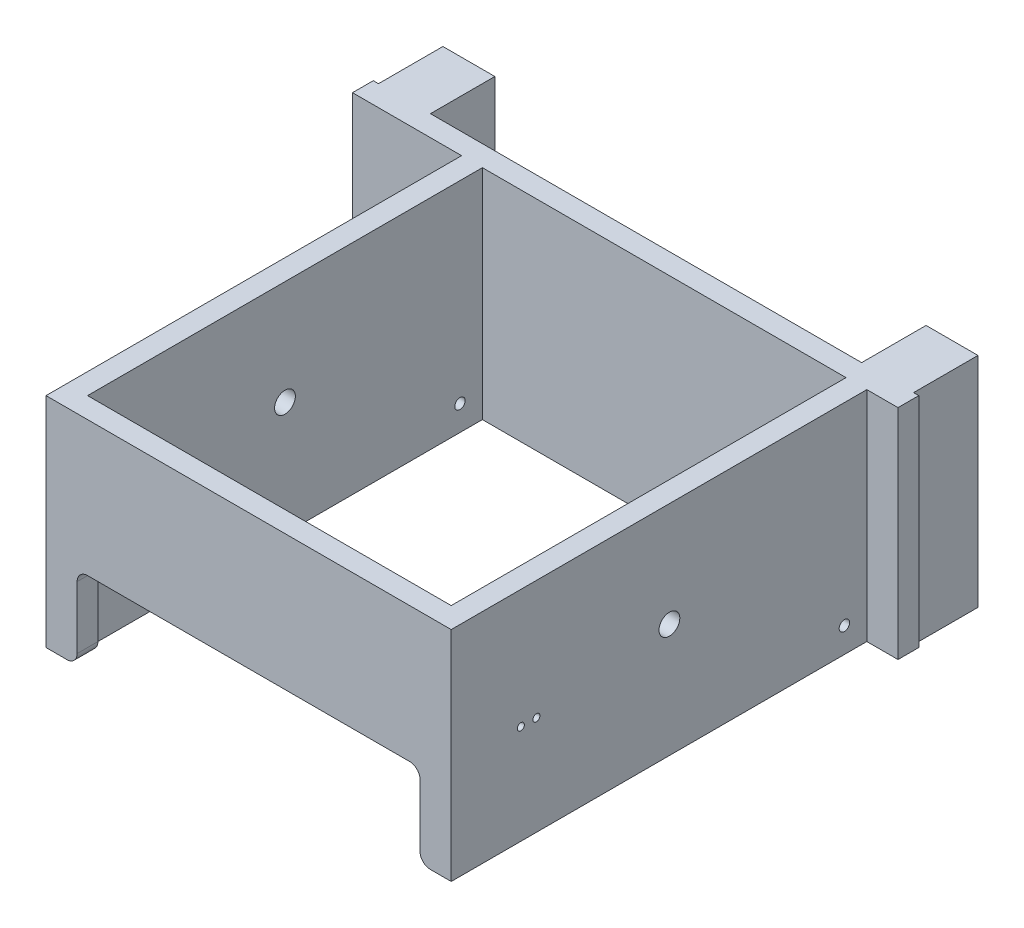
ISO-10303-21;
HEADER;
FILE_DESCRIPTION(('STEP AP214'),'2;1');
FILE_NAME('part.step','',(''),(''),'','','');
FILE_SCHEMA(('AUTOMOTIVE_DESIGN { 1 0 10303 214 1 1 1 1 }'));
ENDSEC;
DATA;
#1=APPLICATION_CONTEXT('core data for automotive mechanical design processes');
#2=APPLICATION_PROTOCOL_DEFINITION('international standard','automotive_design',2000,#1);
#3=PRODUCT_CONTEXT('',#1,'mechanical');
#4=PRODUCT('Part','Part','',(#3));
#5=PRODUCT_RELATED_PRODUCT_CATEGORY('part','',(#4));
#6=PRODUCT_DEFINITION_FORMATION('','',#4);
#7=PRODUCT_DEFINITION_CONTEXT('part definition',#1,'design');
#8=PRODUCT_DEFINITION('design','',#6,#7);
#9=PRODUCT_DEFINITION_SHAPE('','',#8);
#10=(LENGTH_UNIT() NAMED_UNIT(*) SI_UNIT(.MILLI.,.METRE.));
#11=(NAMED_UNIT(*) PLANE_ANGLE_UNIT() SI_UNIT($,.RADIAN.));
#12=(NAMED_UNIT(*) SI_UNIT($,.STERADIAN.) SOLID_ANGLE_UNIT());
#13=UNCERTAINTY_MEASURE_WITH_UNIT(LENGTH_MEASURE(1.E-05),#10,'distance_accuracy_value','');
#14=(GEOMETRIC_REPRESENTATION_CONTEXT(3) GLOBAL_UNCERTAINTY_ASSIGNED_CONTEXT((#13)) GLOBAL_UNIT_ASSIGNED_CONTEXT((#10,
#11,#12)) REPRESENTATION_CONTEXT('',''));
#15=CARTESIAN_POINT('',(0.,0.,0.));
#16=DIRECTION('',(0.,0.,1.));
#17=DIRECTION('',(1.,0.,0.));
#18=AXIS2_PLACEMENT_3D('',#15,#16,#17);
#19=CARTESIAN_POINT('',(-64.7749722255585,-173.320856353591,0.));
#20=DIRECTION('',(0.,0.,1.));
#21=DIRECTION('',(1.,0.,0.));
#22=AXIS2_PLACEMENT_3D('',#19,#20,#21);
#23=PLANE('',#22);
#24=DIRECTION('',(0.,1.,0.));
#25=VECTOR('',#24,1.);
#26=CARTESIAN_POINT('',(405.225027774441,-173.320856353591,0.));
#27=LINE('',#26,#25);
#28=CARTESIAN_POINT('',(405.225027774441,-173.320856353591,0.));
#29=VERTEX_POINT('',#28);
#30=CARTESIAN_POINT('',(405.225027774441,36.6791436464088,0.));
#31=VERTEX_POINT('',#30);
#32=EDGE_CURVE('E297',#29,#31,#27,.T.);
#33=ORIENTED_EDGE('',*,*,#32,.F.);
#34=DIRECTION('',(1.,0.,0.));
#35=VECTOR('',#34,1.);
#36=CARTESIAN_POINT('',(-64.7749722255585,-173.320856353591,0.));
#37=LINE('',#36,#35);
#38=CARTESIAN_POINT('',(-9.77497222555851,-173.320856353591,0.));
#39=VERTEX_POINT('',#38);
#40=EDGE_CURVE('E447',#39,#29,#37,.T.);
#41=ORIENTED_EDGE('',*,*,#40,.F.);
#42=DIRECTION('',(0.,-1.,0.));
#43=VECTOR('',#42,1.);
#44=CARTESIAN_POINT('',(-9.77497222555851,-173.320856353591,0.));
#45=LINE('',#44,#43);
#46=CARTESIAN_POINT('',(-9.77497222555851,36.6791436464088,0.));
#47=VERTEX_POINT('',#46);
#48=EDGE_CURVE('E325',#47,#39,#45,.T.);
#49=ORIENTED_EDGE('',*,*,#48,.F.);
#50=DIRECTION('',(-1.,0.,0.));
#51=VECTOR('',#50,1.);
#52=CARTESIAN_POINT('',(-64.7749722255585,36.6791436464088,0.));
#53=LINE('',#52,#51);
#54=EDGE_CURVE('E347',#31,#47,#53,.T.);
#55=ORIENTED_EDGE('',*,*,#54,.F.);
#56=EDGE_LOOP('',(#33,#41,#49,#55));
#57=FACE_BOUND('',#56,.T.);
#58=ADVANCED_FACE('F39',(#57),#23,.F.);
#59=DIRECTION('',(0.,-1.,0.));
#60=VECTOR('',#59,1.);
#61=CARTESIAN_POINT('',(455.225027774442,-173.320856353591,0.));
#62=LINE('',#61,#60);
#63=CARTESIAN_POINT('',(455.225027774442,36.6791436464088,0.));
#64=VERTEX_POINT('',#63);
#65=CARTESIAN_POINT('',(455.225027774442,-173.320856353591,0.));
#66=VERTEX_POINT('',#65);
#67=EDGE_CURVE('E302',#64,#66,#62,.T.);
#68=ORIENTED_EDGE('',*,*,#67,.F.);
#69=CARTESIAN_POINT('',(460.225027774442,36.6791436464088,0.));
#70=VERTEX_POINT('',#69);
#71=EDGE_CURVE('E350',#70,#64,#53,.T.);
#72=ORIENTED_EDGE('',*,*,#71,.F.);
#73=DIRECTION('',(0.,1.,0.));
#74=VECTOR('',#73,1.);
#75=CARTESIAN_POINT('',(460.225027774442,36.6791436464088,0.));
#76=LINE('',#75,#74);
#77=CARTESIAN_POINT('',(460.225027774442,-173.320856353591,0.));
#78=VERTEX_POINT('',#77);
#79=EDGE_CURVE('E358',#78,#70,#76,.T.);
#80=ORIENTED_EDGE('',*,*,#79,.F.);
#81=EDGE_CURVE('E352',#66,#78,#37,.T.);
#82=ORIENTED_EDGE('',*,*,#81,.F.);
#83=EDGE_LOOP('',(#68,#72,#80,#82));
#84=FACE_BOUND('',#83,.T.);
#85=ADVANCED_FACE('F645',(#84),#23,.F.);
#86=DIRECTION('',(0.,1.,0.));
#87=VECTOR('',#86,1.);
#88=CARTESIAN_POINT('',(-59.7749722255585,-173.320856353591,0.));
#89=LINE('',#88,#87);
#90=CARTESIAN_POINT('',(-59.7749722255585,-173.320856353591,0.));
#91=VERTEX_POINT('',#90);
#92=CARTESIAN_POINT('',(-59.7749722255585,36.6791436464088,0.));
#93=VERTEX_POINT('',#92);
#94=EDGE_CURVE('E320',#91,#93,#89,.T.);
#95=ORIENTED_EDGE('',*,*,#94,.F.);
#96=CARTESIAN_POINT('',(-64.7749722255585,-173.320856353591,0.));
#97=VERTEX_POINT('',#96);
#98=EDGE_CURVE('E452',#97,#91,#37,.T.);
#99=ORIENTED_EDGE('',*,*,#98,.F.);
#100=DIRECTION('',(0.,-1.,0.));
#101=VECTOR('',#100,1.);
#102=CARTESIAN_POINT('',(-64.7749722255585,36.6791436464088,0.));
#103=LINE('',#102,#101);
#104=CARTESIAN_POINT('',(-64.7749722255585,36.6791436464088,0.));
#105=VERTEX_POINT('',#104);
#106=EDGE_CURVE('E401',#105,#97,#103,.T.);
#107=ORIENTED_EDGE('',*,*,#106,.F.);
#108=EDGE_CURVE('E351',#93,#105,#53,.T.);
#109=ORIENTED_EDGE('',*,*,#108,.F.);
#110=EDGE_LOOP('',(#95,#99,#107,#109));
#111=FACE_BOUND('',#110,.T.);
#112=ADVANCED_FACE('F614',(#111),#23,.F.);
#113=CARTESIAN_POINT('',(410.225027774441,36.6791436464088,420.));
#114=DIRECTION('',(1.,0.,0.));
#115=DIRECTION('',(0.,0.,-1.));
#116=AXIS2_PLACEMENT_3D('',#113,#114,#115);
#117=PLANE('',#116);
#118=CARTESIAN_POINT('',(410.225027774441,-77.8208563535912,353.));
#119=DIRECTION('',(1.,0.,0.));
#120=DIRECTION('',(0.,0.,-1.));
#121=AXIS2_PLACEMENT_3D('',#118,#119,#120);
#122=CIRCLE('',#121,3.39999999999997);
#123=CARTESIAN_POINT('',(410.225027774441,-77.8208563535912,349.6));
#124=VERTEX_POINT('',#123);
#125=EDGE_CURVE('E282',#124,#124,#122,.T.);
#126=ORIENTED_EDGE('',*,*,#125,.T.);
#127=EDGE_LOOP('',(#126));
#128=FACE_BOUND('',#127,.T.);
#129=CARTESIAN_POINT('',(410.225027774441,-77.8208563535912,338.));
#130=DIRECTION('',(1.,0.,0.));
#131=DIRECTION('',(0.,0.,-1.));
#132=AXIS2_PLACEMENT_3D('',#129,#130,#131);
#133=CIRCLE('',#132,3.39999999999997);
#134=CARTESIAN_POINT('',(410.225027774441,-77.8208563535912,334.6));
#135=VERTEX_POINT('',#134);
#136=EDGE_CURVE('E291',#135,#135,#133,.T.);
#137=ORIENTED_EDGE('',*,*,#136,.T.);
#138=EDGE_LOOP('',(#137));
#139=FACE_BOUND('',#138,.T.);
#140=CARTESIAN_POINT('',(410.225027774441,-149.158160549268,41.5967225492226));
#141=DIRECTION('',(1.,0.,0.));
#142=DIRECTION('',(0.,0.,-1.));
#143=AXIS2_PLACEMENT_3D('',#140,#141,#142);
#144=CIRCLE('',#143,5.00000000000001);
#145=CARTESIAN_POINT('',(410.225027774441,-149.158160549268,36.5967225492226));
#146=VERTEX_POINT('',#145);
#147=EDGE_CURVE('E480',#146,#146,#144,.T.);
#148=ORIENTED_EDGE('',*,*,#147,.T.);
#149=EDGE_LOOP('',(#148));
#150=FACE_BOUND('',#149,.T.);
#151=CARTESIAN_POINT('',(410.225027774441,-63.8208563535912,210.));
#152=DIRECTION('',(1.,0.,0.));
#153=DIRECTION('',(0.,0.,-1.));
#154=AXIS2_PLACEMENT_3D('',#151,#152,#153);
#155=CIRCLE('',#154,10.);
#156=CARTESIAN_POINT('',(410.225027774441,-63.8208563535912,200.));
#157=VERTEX_POINT('',#156);
#158=EDGE_CURVE('E487',#157,#157,#155,.T.);
#159=ORIENTED_EDGE('',*,*,#158,.T.);
#160=EDGE_LOOP('',(#159));
#161=FACE_BOUND('',#160,.T.);
#162=DIRECTION('',(0.,-1.,0.));
#163=VECTOR('',#162,1.);
#164=CARTESIAN_POINT('',(410.225027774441,36.6791436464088,400.));
#165=LINE('',#164,#163);
#166=CARTESIAN_POINT('',(410.225027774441,36.6791436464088,400.));
#167=VERTEX_POINT('',#166);
#168=CARTESIAN_POINT('',(410.225027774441,-173.320856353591,400.));
#169=VERTEX_POINT('',#168);
#170=EDGE_CURVE('E490',#167,#169,#165,.T.);
#171=ORIENTED_EDGE('',*,*,#170,.F.);
#172=DIRECTION('',(0.,0.,-1.));
#173=VECTOR('',#172,1.);
#174=CARTESIAN_POINT('',(410.225027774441,36.6791436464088,420.));
#175=LINE('',#174,#173);
#176=CARTESIAN_POINT('',(410.225027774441,36.6791436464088,20.));
#177=VERTEX_POINT('',#176);
#178=EDGE_CURVE('E379',#167,#177,#175,.T.);
#179=ORIENTED_EDGE('',*,*,#178,.T.);
#180=DIRECTION('',(0.,-1.,0.));
#181=VECTOR('',#180,1.);
#182=CARTESIAN_POINT('',(410.225027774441,36.6791436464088,20.));
#183=LINE('',#182,#181);
#184=CARTESIAN_POINT('',(410.225027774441,-173.320856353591,20.));
#185=VERTEX_POINT('',#184);
#186=EDGE_CURVE('E390',#177,#185,#183,.T.);
#187=ORIENTED_EDGE('',*,*,#186,.T.);
#188=DIRECTION('',(0.,0.,-1.));
#189=VECTOR('',#188,1.);
#190=CARTESIAN_POINT('',(410.225027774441,-173.320856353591,420.));
#191=LINE('',#190,#189);
#192=EDGE_CURVE('E384',#169,#185,#191,.T.);
#193=ORIENTED_EDGE('',*,*,#192,.F.);
#194=EDGE_LOOP('',(#171,#179,#187,#193));
#195=FACE_BOUND('',#194,.T.);
#196=ADVANCED_FACE('F675',(#128,#139,#150,#161,#195),#117,.F.);
#197=CARTESIAN_POINT('',(60.2250277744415,36.6791436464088,420.));
#198=DIRECTION('',(-1.,0.,0.));
#199=DIRECTION('',(0.,-1.,0.));
#200=AXIS2_PLACEMENT_3D('',#197,#198,#199);
#201=PLANE('',#200);
#202=CARTESIAN_POINT('',(60.2250277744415,-77.8208563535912,353.));
#203=DIRECTION('',(-1.,0.,0.));
#204=DIRECTION('',(0.,-1.,0.));
#205=AXIS2_PLACEMENT_3D('',#202,#203,#204);
#206=CIRCLE('',#205,3.39999999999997);
#207=CARTESIAN_POINT('',(60.2250277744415,-81.2208563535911,353.));
#208=VERTEX_POINT('',#207);
#209=EDGE_CURVE('E279',#208,#208,#206,.T.);
#210=ORIENTED_EDGE('',*,*,#209,.T.);
#211=EDGE_LOOP('',(#210));
#212=FACE_BOUND('',#211,.T.);
#213=CARTESIAN_POINT('',(60.2250277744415,-77.8208563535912,338.));
#214=DIRECTION('',(-1.,0.,0.));
#215=DIRECTION('',(0.,-1.,0.));
#216=AXIS2_PLACEMENT_3D('',#213,#214,#215);
#217=CIRCLE('',#216,3.39999999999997);
#218=CARTESIAN_POINT('',(60.2250277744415,-81.2208563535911,338.));
#219=VERTEX_POINT('',#218);
#220=EDGE_CURVE('E294',#219,#219,#217,.T.);
#221=ORIENTED_EDGE('',*,*,#220,.T.);
#222=EDGE_LOOP('',(#221));
#223=FACE_BOUND('',#222,.T.);
#224=CARTESIAN_POINT('',(60.2250277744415,-149.158160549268,41.5967225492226));
#225=DIRECTION('',(-1.,0.,0.));
#226=DIRECTION('',(0.,-1.,0.));
#227=AXIS2_PLACEMENT_3D('',#224,#225,#226);
#228=CIRCLE('',#227,5.00000000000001);
#229=CARTESIAN_POINT('',(60.2250277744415,-154.158160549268,41.5967225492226));
#230=VERTEX_POINT('',#229);
#231=EDGE_CURVE('E372',#230,#230,#228,.T.);
#232=ORIENTED_EDGE('',*,*,#231,.T.);
#233=EDGE_LOOP('',(#232));
#234=FACE_BOUND('',#233,.T.);
#235=CARTESIAN_POINT('',(60.2250277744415,-63.8208563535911,210.));
#236=DIRECTION('',(-1.,0.,0.));
#237=DIRECTION('',(0.,-1.,0.));
#238=AXIS2_PLACEMENT_3D('',#235,#236,#237);
#239=CIRCLE('',#238,10.);
#240=CARTESIAN_POINT('',(60.2250277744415,-73.8208563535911,210.));
#241=VERTEX_POINT('',#240);
#242=EDGE_CURVE('E377',#241,#241,#239,.T.);
#243=ORIENTED_EDGE('',*,*,#242,.T.);
#244=EDGE_LOOP('',(#243));
#245=FACE_BOUND('',#244,.T.);
#246=DIRECTION('',(0.,-1.,0.));
#247=VECTOR('',#246,1.);
#248=CARTESIAN_POINT('',(60.2250277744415,36.6791436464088,400.));
#249=LINE('',#248,#247);
#250=CARTESIAN_POINT('',(60.2250277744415,36.6791436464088,400.));
#251=VERTEX_POINT('',#250);
#252=CARTESIAN_POINT('',(60.2250277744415,-173.320856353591,400.));
#253=VERTEX_POINT('',#252);
#254=EDGE_CURVE('E491',#251,#253,#249,.T.);
#255=ORIENTED_EDGE('',*,*,#254,.T.);
#256=DIRECTION('',(0.,0.,-1.));
#257=VECTOR('',#256,1.);
#258=CARTESIAN_POINT('',(60.2250277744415,-173.320856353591,420.));
#259=LINE('',#258,#257);
#260=CARTESIAN_POINT('',(60.2250277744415,-173.320856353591,20.));
#261=VERTEX_POINT('',#260);
#262=EDGE_CURVE('E501',#253,#261,#259,.T.);
#263=ORIENTED_EDGE('',*,*,#262,.T.);
#264=DIRECTION('',(0.,1.,0.));
#265=VECTOR('',#264,1.);
#266=CARTESIAN_POINT('',(60.2250277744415,36.6791436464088,20.));
#267=LINE('',#266,#265);
#268=CARTESIAN_POINT('',(60.2250277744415,36.6791436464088,20.));
#269=VERTEX_POINT('',#268);
#270=EDGE_CURVE('E497',#261,#269,#267,.T.);
#271=ORIENTED_EDGE('',*,*,#270,.T.);
#272=DIRECTION('',(0.,0.,-1.));
#273=VECTOR('',#272,1.);
#274=CARTESIAN_POINT('',(60.2250277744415,36.6791436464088,420.));
#275=LINE('',#274,#273);
#276=EDGE_CURVE('E514',#251,#269,#275,.T.);
#277=ORIENTED_EDGE('',*,*,#276,.F.);
#278=EDGE_LOOP('',(#255,#263,#271,#277));
#279=FACE_BOUND('',#278,.T.);
#280=ADVANCED_FACE('F680',(#212,#223,#234,#245,#279),#201,.F.);
#281=CARTESIAN_POINT('',(-64.7749722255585,-173.320856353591,20.));
#282=DIRECTION('',(0.,0.,1.));
#283=DIRECTION('',(1.,0.,0.));
#284=AXIS2_PLACEMENT_3D('',#281,#282,#283);
#285=PLANE('',#284);
#286=DIRECTION('',(-1.,0.,0.));
#287=VECTOR('',#286,1.);
#288=CARTESIAN_POINT('',(-64.7749722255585,36.6791436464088,20.));
#289=LINE('',#288,#287);
#290=EDGE_CURVE('E394',#177,#269,#289,.T.);
#291=ORIENTED_EDGE('',*,*,#290,.T.);
#292=ORIENTED_EDGE('',*,*,#270,.F.);
#293=DIRECTION('',(1.,0.,0.));
#294=VECTOR('',#293,1.);
#295=CARTESIAN_POINT('',(-64.7749722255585,-173.320856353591,20.));
#296=LINE('',#295,#294);
#297=EDGE_CURVE('E396',#261,#185,#296,.T.);
#298=ORIENTED_EDGE('',*,*,#297,.T.);
#299=ORIENTED_EDGE('',*,*,#186,.F.);
#300=EDGE_LOOP('',(#291,#292,#298,#299));
#301=FACE_BOUND('',#300,.T.);
#302=ADVANCED_FACE('F664',(#301),#285,.T.);
#303=CARTESIAN_POINT('',(-64.7749722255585,-173.320856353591,20.));
#304=VERTEX_POINT('',#303);
#305=CARTESIAN_POINT('',(40.2250277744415,-173.320856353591,20.));
#306=VERTEX_POINT('',#305);
#307=EDGE_CURVE('E411',#304,#306,#296,.T.);
#308=ORIENTED_EDGE('',*,*,#307,.T.);
#309=DIRECTION('',(0.,-1.,0.));
#310=VECTOR('',#309,1.);
#311=CARTESIAN_POINT('',(40.2250277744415,36.6791436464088,20.));
#312=LINE('',#311,#310);
#313=CARTESIAN_POINT('',(40.2250277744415,36.6791436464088,20.));
#314=VERTEX_POINT('',#313);
#315=EDGE_CURVE('E502',#314,#306,#312,.T.);
#316=ORIENTED_EDGE('',*,*,#315,.F.);
#317=CARTESIAN_POINT('',(-64.7749722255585,36.6791436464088,20.));
#318=VERTEX_POINT('',#317);
#319=EDGE_CURVE('E392',#314,#318,#289,.T.);
#320=ORIENTED_EDGE('',*,*,#319,.T.);
#321=DIRECTION('',(0.,-1.,0.));
#322=VECTOR('',#321,1.);
#323=CARTESIAN_POINT('',(-64.7749722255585,36.6791436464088,20.));
#324=LINE('',#323,#322);
#325=EDGE_CURVE('E368',#318,#304,#324,.T.);
#326=ORIENTED_EDGE('',*,*,#325,.T.);
#327=EDGE_LOOP('',(#308,#316,#320,#326));
#328=FACE_BOUND('',#327,.T.);
#329=ADVANCED_FACE('F665',(#328),#285,.T.);
#330=CARTESIAN_POINT('',(-64.7749722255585,36.6791436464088,20.));
#331=DIRECTION('',(1.,0.,0.));
#332=DIRECTION('',(0.,1.,0.));
#333=AXIS2_PLACEMENT_3D('',#330,#331,#332);
#334=PLANE('',#333);
#335=ORIENTED_EDGE('',*,*,#106,.T.);
#336=DIRECTION('',(0.,0.,-1.));
#337=VECTOR('',#336,1.);
#338=CARTESIAN_POINT('',(-64.7749722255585,-173.320856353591,20.));
#339=LINE('',#338,#337);
#340=EDGE_CURVE('E603',#304,#97,#339,.T.);
#341=ORIENTED_EDGE('',*,*,#340,.F.);
#342=ORIENTED_EDGE('',*,*,#325,.F.);
#343=DIRECTION('',(0.,0.,-1.));
#344=VECTOR('',#343,1.);
#345=CARTESIAN_POINT('',(-64.7749722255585,36.6791436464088,20.));
#346=LINE('',#345,#344);
#347=EDGE_CURVE('E359',#318,#105,#346,.T.);
#348=ORIENTED_EDGE('',*,*,#347,.T.);
#349=EDGE_LOOP('',(#335,#341,#342,#348));
#350=FACE_BOUND('',#349,.T.);
#351=ADVANCED_FACE('F612',(#350),#334,.F.);
#352=CARTESIAN_POINT('',(-64.7749722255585,-173.320856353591,20.));
#353=DIRECTION('',(0.,1.,0.));
#354=DIRECTION('',(0.,0.,1.));
#355=AXIS2_PLACEMENT_3D('',#352,#353,#354);
#356=PLANE('',#355);
#357=ORIENTED_EDGE('',*,*,#262,.F.);
#358=DIRECTION('',(0.,0.,1.));
#359=VECTOR('',#358,1.);
#360=CARTESIAN_POINT('',(60.2250277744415,-173.320856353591,20.));
#361=LINE('',#360,#359);
#362=CARTESIAN_POINT('',(60.2250277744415,-173.320856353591,420.));
#363=VERTEX_POINT('',#362);
#364=EDGE_CURVE('E537',#253,#363,#361,.T.);
#365=ORIENTED_EDGE('',*,*,#364,.T.);
#366=DIRECTION('',(1.,0.,0.));
#367=VECTOR('',#366,1.);
#368=CARTESIAN_POINT('',(410.225027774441,-173.320856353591,420.));
#369=LINE('',#368,#367);
#370=CARTESIAN_POINT('',(40.2250277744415,-173.320856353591,420.));
#371=VERTEX_POINT('',#370);
#372=EDGE_CURVE('E516',#371,#363,#369,.T.);
#373=ORIENTED_EDGE('',*,*,#372,.F.);
#374=DIRECTION('',(0.,0.,-1.));
#375=VECTOR('',#374,1.);
#376=CARTESIAN_POINT('',(40.2250277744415,-173.320856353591,420.));
#377=LINE('',#376,#375);
#378=EDGE_CURVE('E508',#371,#306,#377,.T.);
#379=ORIENTED_EDGE('',*,*,#378,.T.);
#380=ORIENTED_EDGE('',*,*,#307,.F.);
#381=ORIENTED_EDGE('',*,*,#340,.T.);
#382=ORIENTED_EDGE('',*,*,#98,.T.);
#383=DIRECTION('',(0.,0.,1.));
#384=VECTOR('',#383,1.);
#385=CARTESIAN_POINT('',(-59.7749722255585,-173.320856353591,-62.));
#386=LINE('',#385,#384);
#387=CARTESIAN_POINT('',(-59.7749722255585,-173.320856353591,-62.));
#388=VERTEX_POINT('',#387);
#389=EDGE_CURVE('E331',#388,#91,#386,.T.);
#390=ORIENTED_EDGE('',*,*,#389,.F.);
#391=DIRECTION('',(-1.,0.,0.));
#392=VECTOR('',#391,1.);
#393=CARTESIAN_POINT('',(-59.7749722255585,-173.320856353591,-62.));
#394=LINE('',#393,#392);
#395=CARTESIAN_POINT('',(-9.77497222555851,-173.320856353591,-62.));
#396=VERTEX_POINT('',#395);
#397=EDGE_CURVE('E329',#396,#388,#394,.T.);
#398=ORIENTED_EDGE('',*,*,#397,.F.);
#399=DIRECTION('',(0.,0.,1.));
#400=VECTOR('',#399,1.);
#401=CARTESIAN_POINT('',(-9.77497222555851,-173.320856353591,-62.));
#402=LINE('',#401,#400);
#403=EDGE_CURVE('E344',#396,#39,#402,.T.);
#404=ORIENTED_EDGE('',*,*,#403,.T.);
#405=ORIENTED_EDGE('',*,*,#40,.T.);
#406=DIRECTION('',(0.,0.,1.));
#407=VECTOR('',#406,1.);
#408=CARTESIAN_POINT('',(405.225027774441,-173.320856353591,-62.));
#409=LINE('',#408,#407);
#410=CARTESIAN_POINT('',(405.225027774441,-173.320856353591,-62.));
#411=VERTEX_POINT('',#410);
#412=EDGE_CURVE('E308',#411,#29,#409,.T.);
#413=ORIENTED_EDGE('',*,*,#412,.F.);
#414=DIRECTION('',(-1.,0.,0.));
#415=VECTOR('',#414,1.);
#416=CARTESIAN_POINT('',(405.225027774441,-173.320856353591,-62.));
#417=LINE('',#416,#415);
#418=CARTESIAN_POINT('',(455.225027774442,-173.320856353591,-62.));
#419=VERTEX_POINT('',#418);
#420=EDGE_CURVE('E306',#419,#411,#417,.T.);
#421=ORIENTED_EDGE('',*,*,#420,.F.);
#422=DIRECTION('',(0.,0.,1.));
#423=VECTOR('',#422,1.);
#424=CARTESIAN_POINT('',(455.225027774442,-173.320856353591,-62.));
#425=LINE('',#424,#423);
#426=EDGE_CURVE('E312',#419,#66,#425,.T.);
#427=ORIENTED_EDGE('',*,*,#426,.T.);
#428=ORIENTED_EDGE('',*,*,#81,.T.);
#429=DIRECTION('',(0.,0.,-1.));
#430=VECTOR('',#429,1.);
#431=CARTESIAN_POINT('',(460.225027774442,-173.320856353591,20.));
#432=LINE('',#431,#430);
#433=CARTESIAN_POINT('',(460.225027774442,-173.320856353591,20.));
#434=VERTEX_POINT('',#433);
#435=EDGE_CURVE('E604',#434,#78,#432,.T.);
#436=ORIENTED_EDGE('',*,*,#435,.F.);
#437=CARTESIAN_POINT('',(430.225027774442,-173.320856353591,20.));
#438=VERTEX_POINT('',#437);
#439=EDGE_CURVE('E409',#438,#434,#296,.T.);
#440=ORIENTED_EDGE('',*,*,#439,.F.);
#441=DIRECTION('',(0.,0.,-1.));
#442=VECTOR('',#441,1.);
#443=CARTESIAN_POINT('',(430.225027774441,-173.320856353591,420.));
#444=LINE('',#443,#442);
#445=CARTESIAN_POINT('',(430.225027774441,-173.320856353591,420.));
#446=VERTEX_POINT('',#445);
#447=EDGE_CURVE('E428',#446,#438,#444,.T.);
#448=ORIENTED_EDGE('',*,*,#447,.F.);
#449=CARTESIAN_POINT('',(410.225027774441,-173.320856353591,420.));
#450=VERTEX_POINT('',#449);
#451=EDGE_CURVE('E425',#450,#446,#369,.T.);
#452=ORIENTED_EDGE('',*,*,#451,.F.);
#453=DIRECTION('',(0.,0.,1.));
#454=VECTOR('',#453,1.);
#455=CARTESIAN_POINT('',(410.225027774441,-173.320856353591,20.));
#456=LINE('',#455,#454);
#457=EDGE_CURVE('E571',#450,#169,#456,.F.);
#458=ORIENTED_EDGE('',*,*,#457,.T.);
#459=ORIENTED_EDGE('',*,*,#192,.T.);
#460=ORIENTED_EDGE('',*,*,#297,.F.);
#461=EDGE_LOOP('',(#357,#365,#373,#379,#380,#381,#382,#390,#398,#404,#405,#413,#421,#427,#428,
#436,#440,#448,#452,#458,#459,#460));
#462=FACE_BOUND('',#461,.T.);
#463=ADVANCED_FACE('F533',(#462),#356,.F.);
#464=CARTESIAN_POINT('',(460.225027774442,36.6791436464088,20.));
#465=DIRECTION('',(-1.,0.,0.));
#466=DIRECTION('',(0.,0.,1.));
#467=AXIS2_PLACEMENT_3D('',#464,#465,#466);
#468=PLANE('',#467);
#469=ORIENTED_EDGE('',*,*,#79,.T.);
#470=DIRECTION('',(0.,0.,-1.));
#471=VECTOR('',#470,1.);
#472=CARTESIAN_POINT('',(460.225027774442,36.6791436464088,20.));
#473=LINE('',#472,#471);
#474=CARTESIAN_POINT('',(460.225027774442,36.6791436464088,20.));
#475=VERTEX_POINT('',#474);
#476=EDGE_CURVE('E605',#475,#70,#473,.T.);
#477=ORIENTED_EDGE('',*,*,#476,.F.);
#478=DIRECTION('',(0.,1.,0.));
#479=VECTOR('',#478,1.);
#480=CARTESIAN_POINT('',(460.225027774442,36.6791436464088,20.));
#481=LINE('',#480,#479);
#482=EDGE_CURVE('E395',#434,#475,#481,.T.);
#483=ORIENTED_EDGE('',*,*,#482,.F.);
#484=ORIENTED_EDGE('',*,*,#435,.T.);
#485=EDGE_LOOP('',(#469,#477,#483,#484));
#486=FACE_BOUND('',#485,.T.);
#487=ADVANCED_FACE('F647',(#486),#468,.F.);
#488=CARTESIAN_POINT('',(-64.7749722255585,36.6791436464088,20.));
#489=DIRECTION('',(0.,-1.,0.));
#490=DIRECTION('',(0.,0.,-1.));
#491=AXIS2_PLACEMENT_3D('',#488,#489,#490);
#492=PLANE('',#491);
#493=ORIENTED_EDGE('',*,*,#178,.F.);
#494=DIRECTION('',(1.,0.,0.));
#495=VECTOR('',#494,1.);
#496=CARTESIAN_POINT('',(60.2250277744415,36.6791436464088,400.));
#497=LINE('',#496,#495);
#498=EDGE_CURVE('E494',#251,#167,#497,.T.);
#499=ORIENTED_EDGE('',*,*,#498,.F.);
#500=ORIENTED_EDGE('',*,*,#276,.T.);
#501=ORIENTED_EDGE('',*,*,#290,.F.);
#502=EDGE_LOOP('',(#493,#499,#500,#501));
#503=FACE_BOUND('',#502,.T.);
#504=ORIENTED_EDGE('',*,*,#71,.T.);
#505=DIRECTION('',(0.,0.,1.));
#506=VECTOR('',#505,1.);
#507=CARTESIAN_POINT('',(455.225027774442,36.6791436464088,-62.));
#508=LINE('',#507,#506);
#509=CARTESIAN_POINT('',(455.225027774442,36.6791436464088,-62.));
#510=VERTEX_POINT('',#509);
#511=EDGE_CURVE('E315',#510,#64,#508,.T.);
#512=ORIENTED_EDGE('',*,*,#511,.F.);
#513=DIRECTION('',(1.,0.,0.));
#514=VECTOR('',#513,1.);
#515=CARTESIAN_POINT('',(405.225027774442,36.6791436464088,-62.));
#516=LINE('',#515,#514);
#517=CARTESIAN_POINT('',(405.225027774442,36.6791436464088,-62.));
#518=VERTEX_POINT('',#517);
#519=EDGE_CURVE('E301',#518,#510,#516,.T.);
#520=ORIENTED_EDGE('',*,*,#519,.F.);
#521=DIRECTION('',(0.,0.,1.));
#522=VECTOR('',#521,1.);
#523=CARTESIAN_POINT('',(405.225027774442,36.6791436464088,-62.));
#524=LINE('',#523,#522);
#525=EDGE_CURVE('E317',#518,#31,#524,.T.);
#526=ORIENTED_EDGE('',*,*,#525,.T.);
#527=ORIENTED_EDGE('',*,*,#54,.T.);
#528=DIRECTION('',(0.,0.,1.));
#529=VECTOR('',#528,1.);
#530=CARTESIAN_POINT('',(-9.77497222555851,36.6791436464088,-62.));
#531=LINE('',#530,#529);
#532=CARTESIAN_POINT('',(-9.77497222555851,36.6791436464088,-62.));
#533=VERTEX_POINT('',#532);
#534=EDGE_CURVE('E464',#533,#47,#531,.T.);
#535=ORIENTED_EDGE('',*,*,#534,.F.);
#536=DIRECTION('',(1.,0.,0.));
#537=VECTOR('',#536,1.);
#538=CARTESIAN_POINT('',(-59.7749722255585,36.6791436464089,-62.));
#539=LINE('',#538,#537);
#540=CARTESIAN_POINT('',(-59.7749722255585,36.6791436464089,-62.));
#541=VERTEX_POINT('',#540);
#542=EDGE_CURVE('E324',#541,#533,#539,.T.);
#543=ORIENTED_EDGE('',*,*,#542,.F.);
#544=DIRECTION('',(0.,0.,1.));
#545=VECTOR('',#544,1.);
#546=CARTESIAN_POINT('',(-59.7749722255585,36.6791436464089,-62.));
#547=LINE('',#546,#545);
#548=EDGE_CURVE('E469',#541,#93,#547,.T.);
#549=ORIENTED_EDGE('',*,*,#548,.T.);
#550=ORIENTED_EDGE('',*,*,#108,.T.);
#551=ORIENTED_EDGE('',*,*,#347,.F.);
#552=ORIENTED_EDGE('',*,*,#319,.F.);
#553=DIRECTION('',(0.,0.,-1.));
#554=VECTOR('',#553,1.);
#555=CARTESIAN_POINT('',(40.2250277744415,36.6791436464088,420.));
#556=LINE('',#555,#554);
#557=CARTESIAN_POINT('',(40.2250277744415,36.6791436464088,420.));
#558=VERTEX_POINT('',#557);
#559=EDGE_CURVE('E511',#558,#314,#556,.T.);
#560=ORIENTED_EDGE('',*,*,#559,.F.);
#561=DIRECTION('',(-1.,0.,0.));
#562=VECTOR('',#561,1.);
#563=CARTESIAN_POINT('',(410.225027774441,36.6791436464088,420.));
#564=LINE('',#563,#562);
#565=CARTESIAN_POINT('',(430.225027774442,36.6791436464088,420.));
#566=VERTEX_POINT('',#565);
#567=EDGE_CURVE('E383',#566,#558,#564,.T.);
#568=ORIENTED_EDGE('',*,*,#567,.F.);
#569=DIRECTION('',(0.,0.,-1.));
#570=VECTOR('',#569,1.);
#571=CARTESIAN_POINT('',(430.225027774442,36.6791436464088,420.));
#572=LINE('',#571,#570);
#573=CARTESIAN_POINT('',(430.225027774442,36.6791436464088,20.));
#574=VERTEX_POINT('',#573);
#575=EDGE_CURVE('E382',#566,#574,#572,.T.);
#576=ORIENTED_EDGE('',*,*,#575,.T.);
#577=EDGE_CURVE('E407',#475,#574,#289,.T.);
#578=ORIENTED_EDGE('',*,*,#577,.F.);
#579=ORIENTED_EDGE('',*,*,#476,.T.);
#580=EDGE_LOOP('',(#504,#512,#520,#526,#527,#535,#543,#549,#550,#551,#552,#560,#568,#576,#578,#579));
#581=FACE_BOUND('',#580,.T.);
#582=ADVANCED_FACE('F527',(#503,#581),#492,.F.);
#583=DIRECTION('',(0.,1.,0.));
#584=VECTOR('',#583,1.);
#585=CARTESIAN_POINT('',(430.225027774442,36.6791436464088,20.));
#586=LINE('',#585,#584);
#587=EDGE_CURVE('E422',#438,#574,#586,.T.);
#588=ORIENTED_EDGE('',*,*,#587,.F.);
#589=ORIENTED_EDGE('',*,*,#439,.T.);
#590=ORIENTED_EDGE('',*,*,#482,.T.);
#591=ORIENTED_EDGE('',*,*,#577,.T.);
#592=EDGE_LOOP('',(#588,#589,#590,#591));
#593=FACE_BOUND('',#592,.T.);
#594=ADVANCED_FACE('F652',(#593),#285,.T.);
#595=CARTESIAN_POINT('',(430.225027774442,36.6791436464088,420.));
#596=DIRECTION('',(-1.,0.,0.));
#597=DIRECTION('',(0.,-1.,0.));
#598=AXIS2_PLACEMENT_3D('',#595,#596,#597);
#599=PLANE('',#598);
#600=CARTESIAN_POINT('',(430.225027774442,-77.8208563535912,353.));
#601=DIRECTION('',(-1.,0.,0.));
#602=DIRECTION('',(0.,-1.,0.));
#603=AXIS2_PLACEMENT_3D('',#600,#601,#602);
#604=CIRCLE('',#603,3.39999999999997);
#605=CARTESIAN_POINT('',(430.225027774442,-81.2208563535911,353.));
#606=VERTEX_POINT('',#605);
#607=EDGE_CURVE('E276',#606,#606,#604,.T.);
#608=ORIENTED_EDGE('',*,*,#607,.T.);
#609=EDGE_LOOP('',(#608));
#610=FACE_BOUND('',#609,.T.);
#611=CARTESIAN_POINT('',(430.225027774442,-77.8208563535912,338.));
#612=DIRECTION('',(-1.,0.,0.));
#613=DIRECTION('',(0.,-1.,0.));
#614=AXIS2_PLACEMENT_3D('',#611,#612,#613);
#615=CIRCLE('',#614,3.39999999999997);
#616=CARTESIAN_POINT('',(430.225027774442,-81.2208563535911,338.));
#617=VERTEX_POINT('',#616);
#618=EDGE_CURVE('E288',#617,#617,#615,.T.);
#619=ORIENTED_EDGE('',*,*,#618,.T.);
#620=EDGE_LOOP('',(#619));
#621=FACE_BOUND('',#620,.T.);
#622=CARTESIAN_POINT('',(430.225027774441,-149.158160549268,41.5967225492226));
#623=DIRECTION('',(1.,0.,0.));
#624=DIRECTION('',(0.,1.,0.));
#625=AXIS2_PLACEMENT_3D('',#622,#623,#624);
#626=CIRCLE('',#625,5.00000000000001);
#627=CARTESIAN_POINT('',(430.225027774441,-144.158160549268,41.5967225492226));
#628=VERTEX_POINT('',#627);
#629=EDGE_CURVE('E373',#628,#628,#626,.T.);
#630=ORIENTED_EDGE('',*,*,#629,.F.);
#631=EDGE_LOOP('',(#630));
#632=FACE_BOUND('',#631,.T.);
#633=CARTESIAN_POINT('',(430.225027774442,-63.8208563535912,210.));
#634=DIRECTION('',(1.,0.,0.));
#635=DIRECTION('',(0.,1.,0.));
#636=AXIS2_PLACEMENT_3D('',#633,#634,#635);
#637=CIRCLE('',#636,10.);
#638=CARTESIAN_POINT('',(430.225027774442,-53.8208563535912,210.));
#639=VERTEX_POINT('',#638);
#640=EDGE_CURVE('E378',#639,#639,#637,.T.);
#641=ORIENTED_EDGE('',*,*,#640,.F.);
#642=EDGE_LOOP('',(#641));
#643=FACE_BOUND('',#642,.T.);
#644=ORIENTED_EDGE('',*,*,#587,.T.);
#645=ORIENTED_EDGE('',*,*,#575,.F.);
#646=DIRECTION('',(0.,1.,0.));
#647=VECTOR('',#646,1.);
#648=CARTESIAN_POINT('',(430.225027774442,36.6791436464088,420.));
#649=LINE('',#648,#647);
#650=EDGE_CURVE('E519',#446,#566,#649,.T.);
#651=ORIENTED_EDGE('',*,*,#650,.F.);
#652=ORIENTED_EDGE('',*,*,#447,.T.);
#653=EDGE_LOOP('',(#644,#645,#651,#652));
#654=FACE_BOUND('',#653,.T.);
#655=ADVANCED_FACE('F653',(#610,#621,#632,#643,#654),#599,.F.);
#656=CARTESIAN_POINT('',(410.225027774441,-173.320856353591,420.));
#657=DIRECTION('',(0.,0.,1.));
#658=DIRECTION('',(1.,0.,0.));
#659=AXIS2_PLACEMENT_3D('',#656,#657,#658);
#660=PLANE('',#659);
#661=ORIENTED_EDGE('',*,*,#372,.T.);
#662=CARTESIAN_POINT('',(60.2250277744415,-163.320856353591,420.));
#663=DIRECTION('',(0.,0.,1.));
#664=DIRECTION('',(1.,0.,0.));
#665=AXIS2_PLACEMENT_3D('',#662,#663,#664);
#666=CIRCLE('',#665,10.);
#667=CARTESIAN_POINT('',(70.2250277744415,-163.320856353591,420.));
#668=VERTEX_POINT('',#667);
#669=EDGE_CURVE('E539',#363,#668,#666,.T.);
#670=ORIENTED_EDGE('',*,*,#669,.T.);
#671=DIRECTION('',(0.,-1.,0.));
#672=VECTOR('',#671,1.);
#673=CARTESIAN_POINT('',(70.2250277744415,-173.320856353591,420.));
#674=LINE('',#673,#672);
#675=CARTESIAN_POINT('',(70.2250277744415,-103.320856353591,420.));
#676=VERTEX_POINT('',#675);
#677=EDGE_CURVE('E541',#676,#668,#674,.T.);
#678=ORIENTED_EDGE('',*,*,#677,.F.);
#679=CARTESIAN_POINT('',(80.2250277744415,-103.320856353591,420.));
#680=DIRECTION('',(0.,0.,1.));
#681=DIRECTION('',(1.,0.,0.));
#682=AXIS2_PLACEMENT_3D('',#679,#680,#681);
#683=CIRCLE('',#682,10.);
#684=CARTESIAN_POINT('',(80.2250277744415,-93.3208563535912,420.));
#685=VERTEX_POINT('',#684);
#686=EDGE_CURVE('E581',#676,#685,#683,.F.);
#687=ORIENTED_EDGE('',*,*,#686,.T.);
#688=DIRECTION('',(-1.,0.,0.));
#689=VECTOR('',#688,1.);
#690=CARTESIAN_POINT('',(400.225027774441,-93.3208563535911,420.));
#691=LINE('',#690,#689);
#692=CARTESIAN_POINT('',(390.225027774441,-93.3208563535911,420.));
#693=VERTEX_POINT('',#692);
#694=EDGE_CURVE('E554',#693,#685,#691,.T.);
#695=ORIENTED_EDGE('',*,*,#694,.F.);
#696=CARTESIAN_POINT('',(390.225027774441,-103.320856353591,420.));
#697=DIRECTION('',(0.,0.,1.));
#698=DIRECTION('',(1.,0.,0.));
#699=AXIS2_PLACEMENT_3D('',#696,#697,#698);
#700=CIRCLE('',#699,10.);
#701=CARTESIAN_POINT('',(400.225027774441,-103.320856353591,420.));
#702=VERTEX_POINT('',#701);
#703=EDGE_CURVE('E47',#693,#702,#700,.F.);
#704=ORIENTED_EDGE('',*,*,#703,.T.);
#705=DIRECTION('',(0.,1.,0.));
#706=VECTOR('',#705,1.);
#707=CARTESIAN_POINT('',(400.225027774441,-173.320856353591,420.));
#708=LINE('',#707,#706);
#709=CARTESIAN_POINT('',(400.225027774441,-163.320856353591,420.));
#710=VERTEX_POINT('',#709);
#711=EDGE_CURVE('E586',#710,#702,#708,.T.);
#712=ORIENTED_EDGE('',*,*,#711,.F.);
#713=CARTESIAN_POINT('',(410.225027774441,-163.320856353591,420.));
#714=DIRECTION('',(0.,0.,1.));
#715=DIRECTION('',(1.,0.,0.));
#716=AXIS2_PLACEMENT_3D('',#713,#714,#715);
#717=CIRCLE('',#716,10.);
#718=EDGE_CURVE('E544',#710,#450,#717,.T.);
#719=ORIENTED_EDGE('',*,*,#718,.T.);
#720=ORIENTED_EDGE('',*,*,#451,.T.);
#721=ORIENTED_EDGE('',*,*,#650,.T.);
#722=ORIENTED_EDGE('',*,*,#567,.T.);
#723=DIRECTION('',(0.,-1.,0.));
#724=VECTOR('',#723,1.);
#725=CARTESIAN_POINT('',(40.2250277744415,36.6791436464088,420.));
#726=LINE('',#725,#724);
#727=EDGE_CURVE('E498',#558,#371,#726,.T.);
#728=ORIENTED_EDGE('',*,*,#727,.T.);
#729=EDGE_LOOP('',(#661,#670,#678,#687,#695,#704,#712,#719,#720,#721,#722,#728));
#730=FACE_BOUND('',#729,.T.);
#731=ADVANCED_FACE('F523',(#730),#660,.T.);
#732=CARTESIAN_POINT('',(40.2250277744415,36.6791436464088,420.));
#733=DIRECTION('',(1.,0.,0.));
#734=DIRECTION('',(0.,1.,0.));
#735=AXIS2_PLACEMENT_3D('',#732,#733,#734);
#736=PLANE('',#735);
#737=CARTESIAN_POINT('',(40.2250277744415,-77.8208563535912,353.));
#738=DIRECTION('',(-1.,0.,0.));
#739=DIRECTION('',(0.,0.,1.));
#740=AXIS2_PLACEMENT_3D('',#737,#738,#739);
#741=CIRCLE('',#740,3.4);
#742=CARTESIAN_POINT('',(40.2250277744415,-77.8208563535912,356.4));
#743=VERTEX_POINT('',#742);
#744=EDGE_CURVE('E273',#743,#743,#741,.T.);
#745=ORIENTED_EDGE('',*,*,#744,.F.);
#746=EDGE_LOOP('',(#745));
#747=FACE_BOUND('',#746,.T.);
#748=CARTESIAN_POINT('',(40.2250277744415,-77.8208563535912,338.));
#749=DIRECTION('',(-1.,0.,0.));
#750=DIRECTION('',(0.,0.,1.));
#751=AXIS2_PLACEMENT_3D('',#748,#749,#750);
#752=CIRCLE('',#751,3.4);
#753=CARTESIAN_POINT('',(40.2250277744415,-77.8208563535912,341.4));
#754=VERTEX_POINT('',#753);
#755=EDGE_CURVE('E285',#754,#754,#752,.T.);
#756=ORIENTED_EDGE('',*,*,#755,.F.);
#757=EDGE_LOOP('',(#756));
#758=FACE_BOUND('',#757,.T.);
#759=CARTESIAN_POINT('',(40.2250277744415,-149.158160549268,41.5967225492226));
#760=DIRECTION('',(1.,0.,0.));
#761=DIRECTION('',(0.,1.,0.));
#762=AXIS2_PLACEMENT_3D('',#759,#760,#761);
#763=CIRCLE('',#762,5.00000000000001);
#764=CARTESIAN_POINT('',(40.2250277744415,-144.158160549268,41.5967225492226));
#765=VERTEX_POINT('',#764);
#766=EDGE_CURVE('E369',#765,#765,#763,.T.);
#767=ORIENTED_EDGE('',*,*,#766,.T.);
#768=EDGE_LOOP('',(#767));
#769=FACE_BOUND('',#768,.T.);
#770=CARTESIAN_POINT('',(40.2250277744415,-63.8208563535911,210.));
#771=DIRECTION('',(1.,0.,0.));
#772=DIRECTION('',(0.,1.,0.));
#773=AXIS2_PLACEMENT_3D('',#770,#771,#772);
#774=CIRCLE('',#773,10.);
#775=CARTESIAN_POINT('',(40.2250277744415,-53.8208563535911,210.));
#776=VERTEX_POINT('',#775);
#777=EDGE_CURVE('E374',#776,#776,#774,.T.);
#778=ORIENTED_EDGE('',*,*,#777,.T.);
#779=EDGE_LOOP('',(#778));
#780=FACE_BOUND('',#779,.T.);
#781=ORIENTED_EDGE('',*,*,#315,.T.);
#782=ORIENTED_EDGE('',*,*,#378,.F.);
#783=ORIENTED_EDGE('',*,*,#727,.F.);
#784=ORIENTED_EDGE('',*,*,#559,.T.);
#785=EDGE_LOOP('',(#781,#782,#783,#784));
#786=FACE_BOUND('',#785,.T.);
#787=ADVANCED_FACE('F531',(#747,#758,#769,#780,#786),#736,.F.);
#788=CARTESIAN_POINT('',(60.2250277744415,36.6791436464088,400.));
#789=DIRECTION('',(0.,0.,1.));
#790=DIRECTION('',(1.,0.,0.));
#791=AXIS2_PLACEMENT_3D('',#788,#789,#790);
#792=PLANE('',#791);
#793=DIRECTION('',(0.,-1.,0.));
#794=VECTOR('',#793,1.);
#795=CARTESIAN_POINT('',(70.2250277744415,36.6791436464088,400.));
#796=LINE('',#795,#794);
#797=CARTESIAN_POINT('',(70.2250277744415,-103.320856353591,400.));
#798=VERTEX_POINT('',#797);
#799=CARTESIAN_POINT('',(70.2250277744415,-163.320856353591,400.));
#800=VERTEX_POINT('',#799);
#801=EDGE_CURVE('E563',#798,#800,#796,.T.);
#802=ORIENTED_EDGE('',*,*,#801,.T.);
#803=CARTESIAN_POINT('',(60.2250277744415,-163.320856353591,400.));
#804=DIRECTION('',(0.,0.,1.));
#805=DIRECTION('',(1.,0.,0.));
#806=AXIS2_PLACEMENT_3D('',#803,#804,#805);
#807=CIRCLE('',#806,10.);
#808=EDGE_CURVE('E558',#800,#253,#807,.F.);
#809=ORIENTED_EDGE('',*,*,#808,.T.);
#810=ORIENTED_EDGE('',*,*,#254,.F.);
#811=ORIENTED_EDGE('',*,*,#498,.T.);
#812=ORIENTED_EDGE('',*,*,#170,.T.);
#813=CARTESIAN_POINT('',(410.225027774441,-163.320856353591,400.));
#814=DIRECTION('',(0.,0.,1.));
#815=DIRECTION('',(1.,0.,0.));
#816=AXIS2_PLACEMENT_3D('',#813,#814,#815);
#817=CIRCLE('',#816,10.);
#818=CARTESIAN_POINT('',(400.225027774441,-163.320856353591,400.));
#819=VERTEX_POINT('',#818);
#820=EDGE_CURVE('E61',#169,#819,#817,.F.);
#821=ORIENTED_EDGE('',*,*,#820,.T.);
#822=DIRECTION('',(0.,1.,0.));
#823=VECTOR('',#822,1.);
#824=CARTESIAN_POINT('',(400.225027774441,36.6791436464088,400.));
#825=LINE('',#824,#823);
#826=CARTESIAN_POINT('',(400.225027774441,-103.320856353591,400.));
#827=VERTEX_POINT('',#826);
#828=EDGE_CURVE('E559',#819,#827,#825,.T.);
#829=ORIENTED_EDGE('',*,*,#828,.T.);
#830=CARTESIAN_POINT('',(390.225027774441,-103.320856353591,400.));
#831=DIRECTION('',(0.,0.,1.));
#832=DIRECTION('',(1.,0.,0.));
#833=AXIS2_PLACEMENT_3D('',#830,#831,#832);
#834=CIRCLE('',#833,10.);
#835=CARTESIAN_POINT('',(390.225027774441,-93.3208563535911,400.));
#836=VERTEX_POINT('',#835);
#837=EDGE_CURVE('E11',#827,#836,#834,.T.);
#838=ORIENTED_EDGE('',*,*,#837,.T.);
#839=DIRECTION('',(-1.,0.,0.));
#840=VECTOR('',#839,1.);
#841=CARTESIAN_POINT('',(60.2250277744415,-93.3208563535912,400.));
#842=LINE('',#841,#840);
#843=CARTESIAN_POINT('',(80.2250277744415,-93.3208563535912,400.));
#844=VERTEX_POINT('',#843);
#845=EDGE_CURVE('E598',#836,#844,#842,.T.);
#846=ORIENTED_EDGE('',*,*,#845,.T.);
#847=CARTESIAN_POINT('',(80.2250277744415,-103.320856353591,400.));
#848=DIRECTION('',(0.,0.,1.));
#849=DIRECTION('',(1.,0.,0.));
#850=AXIS2_PLACEMENT_3D('',#847,#848,#849);
#851=CIRCLE('',#850,10.);
#852=EDGE_CURVE('E583',#844,#798,#851,.T.);
#853=ORIENTED_EDGE('',*,*,#852,.T.);
#854=EDGE_LOOP('',(#802,#809,#810,#811,#812,#821,#829,#838,#846,#853));
#855=FACE_BOUND('',#854,.T.);
#856=ADVANCED_FACE('F597',(#855),#792,.F.);
#857=CARTESIAN_POINT('',(-64.7749722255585,-63.8208563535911,210.));
#858=DIRECTION('',(1.,0.,0.));
#859=DIRECTION('',(0.,1.,0.));
#860=AXIS2_PLACEMENT_3D('',#857,#858,#859);
#861=CYLINDRICAL_SURFACE('',#860,10.);
#862=ORIENTED_EDGE('',*,*,#777,.F.);
#863=EDGE_LOOP('',(#862));
#864=FACE_BOUND('',#863,.T.);
#865=ORIENTED_EDGE('',*,*,#242,.F.);
#866=EDGE_LOOP('',(#865));
#867=FACE_BOUND('',#866,.T.);
#868=ADVANCED_FACE('F796',(#864,#867),#861,.F.);
#869=ORIENTED_EDGE('',*,*,#640,.T.);
#870=EDGE_LOOP('',(#869));
#871=FACE_BOUND('',#870,.T.);
#872=ORIENTED_EDGE('',*,*,#158,.F.);
#873=EDGE_LOOP('',(#872));
#874=FACE_BOUND('',#873,.T.);
#875=ADVANCED_FACE('F801',(#871,#874),#861,.F.);
#876=CARTESIAN_POINT('',(-64.7749722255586,-149.158160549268,41.5967225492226));
#877=DIRECTION('',(1.,0.,0.));
#878=DIRECTION('',(0.,1.,0.));
#879=AXIS2_PLACEMENT_3D('',#876,#877,#878);
#880=CYLINDRICAL_SURFACE('',#879,5.00000000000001);
#881=ORIENTED_EDGE('',*,*,#766,.F.);
#882=EDGE_LOOP('',(#881));
#883=FACE_BOUND('',#882,.T.);
#884=ORIENTED_EDGE('',*,*,#231,.F.);
#885=EDGE_LOOP('',(#884));
#886=FACE_BOUND('',#885,.T.);
#887=ADVANCED_FACE('F812',(#883,#886),#880,.F.);
#888=ORIENTED_EDGE('',*,*,#629,.T.);
#889=EDGE_LOOP('',(#888));
#890=FACE_BOUND('',#889,.T.);
#891=ORIENTED_EDGE('',*,*,#147,.F.);
#892=EDGE_LOOP('',(#891));
#893=FACE_BOUND('',#892,.T.);
#894=ADVANCED_FACE('F821',(#890,#893),#880,.F.);
#895=CARTESIAN_POINT('',(-59.7749722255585,-173.320856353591,-62.));
#896=DIRECTION('',(1.,0.,0.));
#897=DIRECTION('',(0.,0.,-1.));
#898=AXIS2_PLACEMENT_3D('',#895,#896,#897);
#899=PLANE('',#898);
#900=ORIENTED_EDGE('',*,*,#94,.T.);
#901=ORIENTED_EDGE('',*,*,#548,.F.);
#902=DIRECTION('',(0.,1.,0.));
#903=VECTOR('',#902,1.);
#904=CARTESIAN_POINT('',(-59.7749722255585,-173.320856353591,-62.));
#905=LINE('',#904,#903);
#906=EDGE_CURVE('E321',#388,#541,#905,.T.);
#907=ORIENTED_EDGE('',*,*,#906,.F.);
#908=ORIENTED_EDGE('',*,*,#389,.T.);
#909=EDGE_LOOP('',(#900,#901,#907,#908));
#910=FACE_BOUND('',#909,.T.);
#911=ADVANCED_FACE('F619',(#910),#899,.F.);
#912=CARTESIAN_POINT('',(-9.77497222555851,-173.320856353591,-62.));
#913=DIRECTION('',(-1.,0.,0.));
#914=DIRECTION('',(0.,0.,1.));
#915=AXIS2_PLACEMENT_3D('',#912,#913,#914);
#916=PLANE('',#915);
#917=ORIENTED_EDGE('',*,*,#48,.T.);
#918=ORIENTED_EDGE('',*,*,#403,.F.);
#919=DIRECTION('',(0.,-1.,0.));
#920=VECTOR('',#919,1.);
#921=CARTESIAN_POINT('',(-9.77497222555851,-173.320856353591,-62.));
#922=LINE('',#921,#920);
#923=EDGE_CURVE('E327',#533,#396,#922,.T.);
#924=ORIENTED_EDGE('',*,*,#923,.F.);
#925=ORIENTED_EDGE('',*,*,#534,.T.);
#926=EDGE_LOOP('',(#917,#918,#924,#925));
#927=FACE_BOUND('',#926,.T.);
#928=ADVANCED_FACE('F626',(#927),#916,.F.);
#929=CARTESIAN_POINT('',(-59.7749722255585,36.6791436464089,-62.));
#930=DIRECTION('',(0.,0.,-1.));
#931=DIRECTION('',(-1.,0.,0.));
#932=AXIS2_PLACEMENT_3D('',#929,#930,#931);
#933=PLANE('',#932);
#934=CARTESIAN_POINT('',(-37.7749722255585,-133.320856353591,-62.));
#935=DIRECTION('',(0.,0.,-1.));
#936=DIRECTION('',(-1.,0.,0.));
#937=AXIS2_PLACEMENT_3D('',#934,#935,#936);
#938=CIRCLE('',#937,5.025);
#939=CARTESIAN_POINT('',(-42.7999722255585,-133.320856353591,-62.));
#940=VERTEX_POINT('',#939);
#941=EDGE_CURVE('E246',#940,#940,#938,.T.);
#942=ORIENTED_EDGE('',*,*,#941,.F.);
#943=EDGE_LOOP('',(#942));
#944=FACE_BOUND('',#943,.T.);
#945=CARTESIAN_POINT('',(-37.7749722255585,-3.32085635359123,-62.));
#946=DIRECTION('',(0.,0.,-1.));
#947=DIRECTION('',(-1.,0.,0.));
#948=AXIS2_PLACEMENT_3D('',#945,#946,#947);
#949=CIRCLE('',#948,5.025);
#950=CARTESIAN_POINT('',(-42.7999722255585,-3.32085635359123,-62.));
#951=VERTEX_POINT('',#950);
#952=EDGE_CURVE('E255',#951,#951,#949,.T.);
#953=ORIENTED_EDGE('',*,*,#952,.F.);
#954=EDGE_LOOP('',(#953));
#955=FACE_BOUND('',#954,.T.);
#956=ORIENTED_EDGE('',*,*,#906,.T.);
#957=ORIENTED_EDGE('',*,*,#542,.T.);
#958=ORIENTED_EDGE('',*,*,#923,.T.);
#959=ORIENTED_EDGE('',*,*,#397,.T.);
#960=EDGE_LOOP('',(#956,#957,#958,#959));
#961=FACE_BOUND('',#960,.T.);
#962=ADVANCED_FACE('F621',(#944,#955,#961),#933,.T.);
#963=CARTESIAN_POINT('',(405.225027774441,-173.320856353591,-62.));
#964=DIRECTION('',(1.,0.,0.));
#965=DIRECTION('',(0.,1.,0.));
#966=AXIS2_PLACEMENT_3D('',#963,#964,#965);
#967=PLANE('',#966);
#968=ORIENTED_EDGE('',*,*,#32,.T.);
#969=ORIENTED_EDGE('',*,*,#525,.F.);
#970=DIRECTION('',(0.,1.,0.));
#971=VECTOR('',#970,1.);
#972=CARTESIAN_POINT('',(405.225027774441,-173.320856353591,-62.));
#973=LINE('',#972,#971);
#974=EDGE_CURVE('E298',#411,#518,#973,.T.);
#975=ORIENTED_EDGE('',*,*,#974,.F.);
#976=ORIENTED_EDGE('',*,*,#412,.T.);
#977=EDGE_LOOP('',(#968,#969,#975,#976));
#978=FACE_BOUND('',#977,.T.);
#979=ADVANCED_FACE('F633',(#978),#967,.F.);
#980=CARTESIAN_POINT('',(455.225027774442,-173.320856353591,-62.));
#981=DIRECTION('',(-1.,0.,0.));
#982=DIRECTION('',(0.,0.,1.));
#983=AXIS2_PLACEMENT_3D('',#980,#981,#982);
#984=PLANE('',#983);
#985=ORIENTED_EDGE('',*,*,#67,.T.);
#986=ORIENTED_EDGE('',*,*,#426,.F.);
#987=DIRECTION('',(0.,-1.,0.));
#988=VECTOR('',#987,1.);
#989=CARTESIAN_POINT('',(455.225027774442,-173.320856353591,-62.));
#990=LINE('',#989,#988);
#991=EDGE_CURVE('E304',#510,#419,#990,.T.);
#992=ORIENTED_EDGE('',*,*,#991,.F.);
#993=ORIENTED_EDGE('',*,*,#511,.T.);
#994=EDGE_LOOP('',(#985,#986,#992,#993));
#995=FACE_BOUND('',#994,.T.);
#996=ADVANCED_FACE('F872',(#995),#984,.F.);
#997=CARTESIAN_POINT('',(405.225027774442,36.6791436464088,-62.));
#998=DIRECTION('',(0.,0.,-1.));
#999=DIRECTION('',(-1.,0.,0.));
#1000=AXIS2_PLACEMENT_3D('',#997,#998,#999);
#1001=PLANE('',#1000);
#1002=CARTESIAN_POINT('',(433.225027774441,-133.320856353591,-62.));
#1003=DIRECTION('',(0.,0.,-1.));
#1004=DIRECTION('',(-1.,0.,0.));
#1005=AXIS2_PLACEMENT_3D('',#1002,#1003,#1004);
#1006=CIRCLE('',#1005,5.025);
#1007=CARTESIAN_POINT('',(428.200027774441,-133.320856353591,-62.));
#1008=VERTEX_POINT('',#1007);
#1009=EDGE_CURVE('E239',#1008,#1008,#1006,.T.);
#1010=ORIENTED_EDGE('',*,*,#1009,.F.);
#1011=EDGE_LOOP('',(#1010));
#1012=FACE_BOUND('',#1011,.T.);
#1013=CARTESIAN_POINT('',(433.225027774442,-3.32085635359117,-62.));
#1014=DIRECTION('',(0.,0.,-1.));
#1015=DIRECTION('',(-1.,0.,0.));
#1016=AXIS2_PLACEMENT_3D('',#1013,#1014,#1015);
#1017=CIRCLE('',#1016,5.025);
#1018=CARTESIAN_POINT('',(428.200027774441,-3.32085635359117,-62.));
#1019=VERTEX_POINT('',#1018);
#1020=EDGE_CURVE('E264',#1019,#1019,#1017,.T.);
#1021=ORIENTED_EDGE('',*,*,#1020,.F.);
#1022=EDGE_LOOP('',(#1021));
#1023=FACE_BOUND('',#1022,.T.);
#1024=ORIENTED_EDGE('',*,*,#974,.T.);
#1025=ORIENTED_EDGE('',*,*,#519,.T.);
#1026=ORIENTED_EDGE('',*,*,#991,.T.);
#1027=ORIENTED_EDGE('',*,*,#420,.T.);
#1028=EDGE_LOOP('',(#1024,#1025,#1026,#1027));
#1029=FACE_BOUND('',#1028,.T.);
#1030=ADVANCED_FACE('F638',(#1012,#1023,#1029),#1001,.T.);
#1031=CARTESIAN_POINT('',(40.2250277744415,-77.8208563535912,338.));
#1032=DIRECTION('',(-1.,0.,0.));
#1033=DIRECTION('',(0.,0.,1.));
#1034=AXIS2_PLACEMENT_3D('',#1031,#1032,#1033);
#1035=CYLINDRICAL_SURFACE('',#1034,3.39999999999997);
#1036=ORIENTED_EDGE('',*,*,#755,.T.);
#1037=EDGE_LOOP('',(#1036));
#1038=FACE_BOUND('',#1037,.T.);
#1039=ORIENTED_EDGE('',*,*,#220,.F.);
#1040=EDGE_LOOP('',(#1039));
#1041=FACE_BOUND('',#1040,.T.);
#1042=ADVANCED_FACE('F884',(#1038,#1041),#1035,.F.);
#1043=ORIENTED_EDGE('',*,*,#618,.F.);
#1044=EDGE_LOOP('',(#1043));
#1045=FACE_BOUND('',#1044,.T.);
#1046=ORIENTED_EDGE('',*,*,#136,.F.);
#1047=EDGE_LOOP('',(#1046));
#1048=FACE_BOUND('',#1047,.T.);
#1049=ADVANCED_FACE('F895',(#1045,#1048),#1035,.F.);
#1050=CARTESIAN_POINT('',(40.2250277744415,-77.8208563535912,353.));
#1051=DIRECTION('',(-1.,0.,0.));
#1052=DIRECTION('',(0.,0.,1.));
#1053=AXIS2_PLACEMENT_3D('',#1050,#1051,#1052);
#1054=CYLINDRICAL_SURFACE('',#1053,3.39999999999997);
#1055=ORIENTED_EDGE('',*,*,#744,.T.);
#1056=EDGE_LOOP('',(#1055));
#1057=FACE_BOUND('',#1056,.T.);
#1058=ORIENTED_EDGE('',*,*,#209,.F.);
#1059=EDGE_LOOP('',(#1058));
#1060=FACE_BOUND('',#1059,.T.);
#1061=ADVANCED_FACE('F903',(#1057,#1060),#1054,.F.);
#1062=ORIENTED_EDGE('',*,*,#607,.F.);
#1063=EDGE_LOOP('',(#1062));
#1064=FACE_BOUND('',#1063,.T.);
#1065=ORIENTED_EDGE('',*,*,#125,.F.);
#1066=EDGE_LOOP('',(#1065));
#1067=FACE_BOUND('',#1066,.T.);
#1068=ADVANCED_FACE('F910',(#1064,#1067),#1054,.F.);
#1069=CARTESIAN_POINT('',(433.225027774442,-3.32085635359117,-27.5));
#1070=DIRECTION('',(0.,0.,-1.));
#1071=DIRECTION('',(-1.,0.,0.));
#1072=AXIS2_PLACEMENT_3D('',#1069,#1070,#1071);
#1073=CONICAL_SURFACE('',#1072,4.24999999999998,1.02974425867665);
#1074=CARTESIAN_POINT('',(433.225027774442,-3.32085635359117,-24.9463423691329));
#1075=VERTEX_POINT('',#1074);
#1076=VERTEX_LOOP('',#1075);
#1077=FACE_BOUND('',#1076,.T.);
#1078=CARTESIAN_POINT('',(433.225027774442,-3.32085635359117,-27.5));
#1079=DIRECTION('',(0.,0.,-1.));
#1080=DIRECTION('',(-1.,0.,0.));
#1081=AXIS2_PLACEMENT_3D('',#1078,#1079,#1080);
#1082=CIRCLE('',#1081,4.24999999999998);
#1083=CARTESIAN_POINT('',(428.975027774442,-3.32085635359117,-27.5));
#1084=VERTEX_POINT('',#1083);
#1085=EDGE_CURVE('E270',#1084,#1084,#1082,.T.);
#1086=ORIENTED_EDGE('',*,*,#1085,.T.);
#1087=EDGE_LOOP('',(#1086));
#1088=FACE_BOUND('',#1087,.T.);
#1089=ADVANCED_FACE('F918',(#1077,#1088),#1073,.F.);
#1090=CARTESIAN_POINT('',(433.225027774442,-3.32085635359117,-62.));
#1091=DIRECTION('',(0.,0.,-1.));
#1092=DIRECTION('',(-1.,0.,0.));
#1093=AXIS2_PLACEMENT_3D('',#1090,#1091,#1092);
#1094=CYLINDRICAL_SURFACE('',#1093,4.24999999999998);
#1095=ORIENTED_EDGE('',*,*,#1085,.F.);
#1096=EDGE_LOOP('',(#1095));
#1097=FACE_BOUND('',#1096,.T.);
#1098=CARTESIAN_POINT('',(433.225027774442,-3.32085635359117,-61.225));
#1099=DIRECTION('',(0.,0.,-1.));
#1100=DIRECTION('',(-1.,0.,0.));
#1101=AXIS2_PLACEMENT_3D('',#1098,#1099,#1100);
#1102=CIRCLE('',#1101,4.24999999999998);
#1103=CARTESIAN_POINT('',(428.975027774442,-3.32085635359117,-61.225));
#1104=VERTEX_POINT('',#1103);
#1105=EDGE_CURVE('E267',#1104,#1104,#1102,.T.);
#1106=ORIENTED_EDGE('',*,*,#1105,.T.);
#1107=EDGE_LOOP('',(#1106));
#1108=FACE_BOUND('',#1107,.T.);
#1109=ADVANCED_FACE('F926',(#1097,#1108),#1094,.F.);
#1110=CARTESIAN_POINT('',(433.225027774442,-3.32085635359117,-62.));
#1111=DIRECTION('',(0.,0.,-1.));
#1112=DIRECTION('',(-1.,0.,0.));
#1113=AXIS2_PLACEMENT_3D('',#1110,#1111,#1112);
#1114=CONICAL_SURFACE('',#1113,5.025,0.785398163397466);
#1115=ORIENTED_EDGE('',*,*,#1105,.F.);
#1116=EDGE_LOOP('',(#1115));
#1117=FACE_BOUND('',#1116,.T.);
#1118=ORIENTED_EDGE('',*,*,#1020,.T.);
#1119=EDGE_LOOP('',(#1118));
#1120=FACE_BOUND('',#1119,.T.);
#1121=ADVANCED_FACE('F935',(#1117,#1120),#1114,.F.);
#1122=CARTESIAN_POINT('',(-37.7749722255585,-3.32085635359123,-27.5));
#1123=DIRECTION('',(0.,0.,-1.));
#1124=DIRECTION('',(-1.,0.,0.));
#1125=AXIS2_PLACEMENT_3D('',#1122,#1123,#1124);
#1126=CONICAL_SURFACE('',#1125,4.25,1.02974425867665);
#1127=CARTESIAN_POINT('',(-37.7749722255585,-3.32085635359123,-24.9463423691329));
#1128=VERTEX_POINT('',#1127);
#1129=VERTEX_LOOP('',#1128);
#1130=FACE_BOUND('',#1129,.T.);
#1131=CARTESIAN_POINT('',(-37.7749722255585,-3.32085635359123,-27.5));
#1132=DIRECTION('',(0.,0.,-1.));
#1133=DIRECTION('',(-1.,0.,0.));
#1134=AXIS2_PLACEMENT_3D('',#1131,#1132,#1133);
#1135=CIRCLE('',#1134,4.25);
#1136=CARTESIAN_POINT('',(-42.0249722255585,-3.32085635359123,-27.5));
#1137=VERTEX_POINT('',#1136);
#1138=EDGE_CURVE('E261',#1137,#1137,#1135,.T.);
#1139=ORIENTED_EDGE('',*,*,#1138,.T.);
#1140=EDGE_LOOP('',(#1139));
#1141=FACE_BOUND('',#1140,.T.);
#1142=ADVANCED_FACE('F942',(#1130,#1141),#1126,.F.);
#1143=CARTESIAN_POINT('',(-37.7749722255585,-3.32085635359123,-62.));
#1144=DIRECTION('',(0.,0.,-1.));
#1145=DIRECTION('',(-1.,0.,0.));
#1146=AXIS2_PLACEMENT_3D('',#1143,#1144,#1145);
#1147=CYLINDRICAL_SURFACE('',#1146,4.25);
#1148=ORIENTED_EDGE('',*,*,#1138,.F.);
#1149=EDGE_LOOP('',(#1148));
#1150=FACE_BOUND('',#1149,.T.);
#1151=CARTESIAN_POINT('',(-37.7749722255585,-3.32085635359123,-61.225));
#1152=DIRECTION('',(0.,0.,-1.));
#1153=DIRECTION('',(-1.,0.,0.));
#1154=AXIS2_PLACEMENT_3D('',#1151,#1152,#1153);
#1155=CIRCLE('',#1154,4.25);
#1156=CARTESIAN_POINT('',(-42.0249722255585,-3.32085635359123,-61.225));
#1157=VERTEX_POINT('',#1156);
#1158=EDGE_CURVE('E258',#1157,#1157,#1155,.T.);
#1159=ORIENTED_EDGE('',*,*,#1158,.T.);
#1160=EDGE_LOOP('',(#1159));
#1161=FACE_BOUND('',#1160,.T.);
#1162=ADVANCED_FACE('F949',(#1150,#1161),#1147,.F.);
#1163=CARTESIAN_POINT('',(-37.7749722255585,-3.32085635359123,-62.));
#1164=DIRECTION('',(0.,0.,-1.));
#1165=DIRECTION('',(-1.,0.,0.));
#1166=AXIS2_PLACEMENT_3D('',#1163,#1164,#1165);
#1167=CONICAL_SURFACE('',#1166,5.025,0.785398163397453);
#1168=ORIENTED_EDGE('',*,*,#1158,.F.);
#1169=EDGE_LOOP('',(#1168));
#1170=FACE_BOUND('',#1169,.T.);
#1171=ORIENTED_EDGE('',*,*,#952,.T.);
#1172=EDGE_LOOP('',(#1171));
#1173=FACE_BOUND('',#1172,.T.);
#1174=ADVANCED_FACE('F958',(#1170,#1173),#1167,.F.);
#1175=CARTESIAN_POINT('',(433.225027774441,-133.320856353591,-27.5));
#1176=DIRECTION('',(0.,0.,-1.));
#1177=DIRECTION('',(-1.,0.,0.));
#1178=AXIS2_PLACEMENT_3D('',#1175,#1176,#1177);
#1179=CONICAL_SURFACE('',#1178,4.24999999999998,1.02974425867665);
#1180=CARTESIAN_POINT('',(433.225027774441,-133.320856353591,-24.9463423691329));
#1181=VERTEX_POINT('',#1180);
#1182=VERTEX_LOOP('',#1181);
#1183=FACE_BOUND('',#1182,.T.);
#1184=CARTESIAN_POINT('',(433.225027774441,-133.320856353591,-27.5));
#1185=DIRECTION('',(0.,0.,-1.));
#1186=DIRECTION('',(-1.,0.,0.));
#1187=AXIS2_PLACEMENT_3D('',#1184,#1185,#1186);
#1188=CIRCLE('',#1187,4.24999999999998);
#1189=CARTESIAN_POINT('',(428.975027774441,-133.320856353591,-27.5));
#1190=VERTEX_POINT('',#1189);
#1191=EDGE_CURVE('E252',#1190,#1190,#1188,.T.);
#1192=ORIENTED_EDGE('',*,*,#1191,.T.);
#1193=EDGE_LOOP('',(#1192));
#1194=FACE_BOUND('',#1193,.T.);
#1195=ADVANCED_FACE('F967',(#1183,#1194),#1179,.F.);
#1196=CARTESIAN_POINT('',(433.225027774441,-133.320856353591,-62.));
#1197=DIRECTION('',(0.,0.,-1.));
#1198=DIRECTION('',(-1.,0.,0.));
#1199=AXIS2_PLACEMENT_3D('',#1196,#1197,#1198);
#1200=CYLINDRICAL_SURFACE('',#1199,4.24999999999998);
#1201=ORIENTED_EDGE('',*,*,#1191,.F.);
#1202=EDGE_LOOP('',(#1201));
#1203=FACE_BOUND('',#1202,.T.);
#1204=CARTESIAN_POINT('',(433.225027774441,-133.320856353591,-61.225));
#1205=DIRECTION('',(0.,0.,-1.));
#1206=DIRECTION('',(-1.,0.,0.));
#1207=AXIS2_PLACEMENT_3D('',#1204,#1205,#1206);
#1208=CIRCLE('',#1207,4.24999999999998);
#1209=CARTESIAN_POINT('',(428.975027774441,-133.320856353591,-61.225));
#1210=VERTEX_POINT('',#1209);
#1211=EDGE_CURVE('E243',#1210,#1210,#1208,.T.);
#1212=ORIENTED_EDGE('',*,*,#1211,.T.);
#1213=EDGE_LOOP('',(#1212));
#1214=FACE_BOUND('',#1213,.T.);
#1215=ADVANCED_FACE('F975',(#1203,#1214),#1200,.F.);
#1216=CARTESIAN_POINT('',(433.225027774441,-133.320856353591,-62.));
#1217=DIRECTION('',(0.,0.,-1.));
#1218=DIRECTION('',(-1.,0.,0.));
#1219=AXIS2_PLACEMENT_3D('',#1216,#1217,#1218);
#1220=CONICAL_SURFACE('',#1219,5.025,0.785398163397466);
#1221=ORIENTED_EDGE('',*,*,#1211,.F.);
#1222=EDGE_LOOP('',(#1221));
#1223=FACE_BOUND('',#1222,.T.);
#1224=ORIENTED_EDGE('',*,*,#1009,.T.);
#1225=EDGE_LOOP('',(#1224));
#1226=FACE_BOUND('',#1225,.T.);
#1227=ADVANCED_FACE('F233',(#1223,#1226),#1220,.F.);
#1228=CARTESIAN_POINT('',(-37.7749722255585,-133.320856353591,-27.5));
#1229=DIRECTION('',(0.,0.,-1.));
#1230=DIRECTION('',(-1.,0.,0.));
#1231=AXIS2_PLACEMENT_3D('',#1228,#1229,#1230);
#1232=CONICAL_SURFACE('',#1231,4.25,1.02974425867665);
#1233=CARTESIAN_POINT('',(-37.7749722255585,-133.320856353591,-24.9463423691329));
#1234=VERTEX_POINT('',#1233);
#1235=VERTEX_LOOP('',#1234);
#1236=FACE_BOUND('',#1235,.T.);
#1237=CARTESIAN_POINT('',(-37.7749722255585,-133.320856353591,-27.5));
#1238=DIRECTION('',(0.,0.,-1.));
#1239=DIRECTION('',(-1.,0.,0.));
#1240=AXIS2_PLACEMENT_3D('',#1237,#1238,#1239);
#1241=CIRCLE('',#1240,4.25);
#1242=CARTESIAN_POINT('',(-42.0249722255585,-133.320856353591,-27.5));
#1243=VERTEX_POINT('',#1242);
#1244=EDGE_CURVE('E237',#1243,#1243,#1241,.T.);
#1245=ORIENTED_EDGE('',*,*,#1244,.T.);
#1246=EDGE_LOOP('',(#1245));
#1247=FACE_BOUND('',#1246,.T.);
#1248=ADVANCED_FACE('F229',(#1236,#1247),#1232,.F.);
#1249=CARTESIAN_POINT('',(-37.7749722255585,-133.320856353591,-62.));
#1250=DIRECTION('',(0.,0.,-1.));
#1251=DIRECTION('',(-1.,0.,0.));
#1252=AXIS2_PLACEMENT_3D('',#1249,#1250,#1251);
#1253=CYLINDRICAL_SURFACE('',#1252,4.25);
#1254=ORIENTED_EDGE('',*,*,#1244,.F.);
#1255=EDGE_LOOP('',(#1254));
#1256=FACE_BOUND('',#1255,.T.);
#1257=CARTESIAN_POINT('',(-37.7749722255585,-133.320856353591,-61.225));
#1258=DIRECTION('',(0.,0.,-1.));
#1259=DIRECTION('',(-1.,0.,0.));
#1260=AXIS2_PLACEMENT_3D('',#1257,#1258,#1259);
#1261=CIRCLE('',#1260,4.25);
#1262=CARTESIAN_POINT('',(-42.0249722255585,-133.320856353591,-61.225));
#1263=VERTEX_POINT('',#1262);
#1264=EDGE_CURVE('E240',#1263,#1263,#1261,.T.);
#1265=ORIENTED_EDGE('',*,*,#1264,.T.);
#1266=EDGE_LOOP('',(#1265));
#1267=FACE_BOUND('',#1266,.T.);
#1268=ADVANCED_FACE('F232',(#1256,#1267),#1253,.F.);
#1269=CARTESIAN_POINT('',(-37.7749722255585,-133.320856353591,-62.));
#1270=DIRECTION('',(0.,0.,-1.));
#1271=DIRECTION('',(-1.,0.,0.));
#1272=AXIS2_PLACEMENT_3D('',#1269,#1270,#1271);
#1273=CONICAL_SURFACE('',#1272,5.025,0.785398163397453);
#1274=ORIENTED_EDGE('',*,*,#1264,.F.);
#1275=EDGE_LOOP('',(#1274));
#1276=FACE_BOUND('',#1275,.T.);
#1277=ORIENTED_EDGE('',*,*,#941,.T.);
#1278=EDGE_LOOP('',(#1277));
#1279=FACE_BOUND('',#1278,.T.);
#1280=ADVANCED_FACE('F1001',(#1276,#1279),#1273,.F.);
#1281=CARTESIAN_POINT('',(400.225027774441,-173.320856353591,390.));
#1282=DIRECTION('',(1.,0.,0.));
#1283=DIRECTION('',(0.,0.,-1.));
#1284=AXIS2_PLACEMENT_3D('',#1281,#1282,#1283);
#1285=PLANE('',#1284);
#1286=ORIENTED_EDGE('',*,*,#711,.T.);
#1287=DIRECTION('',(0.,0.,1.));
#1288=VECTOR('',#1287,1.);
#1289=CARTESIAN_POINT('',(400.225027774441,-103.320856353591,400.));
#1290=LINE('',#1289,#1288);
#1291=EDGE_CURVE('E54',#702,#827,#1290,.F.);
#1292=ORIENTED_EDGE('',*,*,#1291,.T.);
#1293=ORIENTED_EDGE('',*,*,#828,.F.);
#1294=DIRECTION('',(0.,0.,1.));
#1295=VECTOR('',#1294,1.);
#1296=CARTESIAN_POINT('',(400.225027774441,-163.320856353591,390.));
#1297=LINE('',#1296,#1295);
#1298=EDGE_CURVE('E577',#819,#710,#1297,.T.);
#1299=ORIENTED_EDGE('',*,*,#1298,.T.);
#1300=EDGE_LOOP('',(#1286,#1292,#1293,#1299));
#1301=FACE_BOUND('',#1300,.T.);
#1302=ADVANCED_FACE('F590',(#1301),#1285,.F.);
#1303=CARTESIAN_POINT('',(70.2250277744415,-173.320856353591,390.));
#1304=DIRECTION('',(-1.,0.,0.));
#1305=DIRECTION('',(0.,0.,1.));
#1306=AXIS2_PLACEMENT_3D('',#1303,#1304,#1305);
#1307=PLANE('',#1306);
#1308=ORIENTED_EDGE('',*,*,#801,.F.);
#1309=DIRECTION('',(0.,0.,1.));
#1310=VECTOR('',#1309,1.);
#1311=CARTESIAN_POINT('',(70.2250277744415,-103.320856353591,420.));
#1312=LINE('',#1311,#1310);
#1313=EDGE_CURVE('E553',#798,#676,#1312,.T.);
#1314=ORIENTED_EDGE('',*,*,#1313,.T.);
#1315=ORIENTED_EDGE('',*,*,#677,.T.);
#1316=DIRECTION('',(0.,0.,1.));
#1317=VECTOR('',#1316,1.);
#1318=CARTESIAN_POINT('',(70.2250277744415,-163.320856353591,390.));
#1319=LINE('',#1318,#1317);
#1320=EDGE_CURVE('E550',#668,#800,#1319,.F.);
#1321=ORIENTED_EDGE('',*,*,#1320,.T.);
#1322=EDGE_LOOP('',(#1308,#1314,#1315,#1321));
#1323=FACE_BOUND('',#1322,.T.);
#1324=ADVANCED_FACE('F549',(#1323),#1307,.F.);
#1325=CARTESIAN_POINT('',(400.225027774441,-93.3208563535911,390.));
#1326=DIRECTION('',(0.,1.,0.));
#1327=DIRECTION('',(-1.,0.,0.));
#1328=AXIS2_PLACEMENT_3D('',#1325,#1326,#1327);
#1329=PLANE('',#1328);
#1330=ORIENTED_EDGE('',*,*,#694,.T.);
#1331=DIRECTION('',(0.,0.,1.));
#1332=VECTOR('',#1331,1.);
#1333=CARTESIAN_POINT('',(80.2250277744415,-93.3208563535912,400.));
#1334=LINE('',#1333,#1332);
#1335=EDGE_CURVE('E569',#685,#844,#1334,.F.);
#1336=ORIENTED_EDGE('',*,*,#1335,.T.);
#1337=ORIENTED_EDGE('',*,*,#845,.F.);
#1338=DIRECTION('',(0.,0.,1.));
#1339=VECTOR('',#1338,1.);
#1340=CARTESIAN_POINT('',(390.225027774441,-93.3208563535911,420.));
#1341=LINE('',#1340,#1339);
#1342=EDGE_CURVE('E561',#836,#693,#1341,.T.);
#1343=ORIENTED_EDGE('',*,*,#1342,.T.);
#1344=EDGE_LOOP('',(#1330,#1336,#1337,#1343));
#1345=FACE_BOUND('',#1344,.T.);
#1346=ADVANCED_FACE('F601',(#1345),#1329,.F.);
#1347=CARTESIAN_POINT('',(80.2250277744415,-103.320856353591,390.));
#1348=DIRECTION('',(0.,0.,-1.));
#1349=DIRECTION('',(-1.,0.,0.));
#1350=AXIS2_PLACEMENT_3D('',#1347,#1348,#1349);
#1351=CYLINDRICAL_SURFACE('',#1350,10.);
#1352=ORIENTED_EDGE('',*,*,#852,.F.);
#1353=ORIENTED_EDGE('',*,*,#1335,.F.);
#1354=ORIENTED_EDGE('',*,*,#686,.F.);
#1355=ORIENTED_EDGE('',*,*,#1313,.F.);
#1356=EDGE_LOOP('',(#1352,#1353,#1354,#1355));
#1357=FACE_BOUND('',#1356,.T.);
#1358=ADVANCED_FACE('F1027',(#1357),#1351,.F.);
#1359=CARTESIAN_POINT('',(60.2250277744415,-163.320856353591,20.));
#1360=DIRECTION('',(0.,0.,1.));
#1361=DIRECTION('',(1.,0.,0.));
#1362=AXIS2_PLACEMENT_3D('',#1359,#1360,#1361);
#1363=CYLINDRICAL_SURFACE('',#1362,10.);
#1364=ORIENTED_EDGE('',*,*,#808,.F.);
#1365=ORIENTED_EDGE('',*,*,#1320,.F.);
#1366=ORIENTED_EDGE('',*,*,#669,.F.);
#1367=ORIENTED_EDGE('',*,*,#364,.F.);
#1368=EDGE_LOOP('',(#1364,#1365,#1366,#1367));
#1369=FACE_BOUND('',#1368,.T.);
#1370=ADVANCED_FACE('F557',(#1369),#1363,.T.);
#1371=CARTESIAN_POINT('',(390.225027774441,-103.320856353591,390.));
#1372=DIRECTION('',(0.,0.,-1.));
#1373=DIRECTION('',(-1.,0.,0.));
#1374=AXIS2_PLACEMENT_3D('',#1371,#1372,#1373);
#1375=CYLINDRICAL_SURFACE('',#1374,10.);
#1376=ORIENTED_EDGE('',*,*,#837,.F.);
#1377=ORIENTED_EDGE('',*,*,#1291,.F.);
#1378=ORIENTED_EDGE('',*,*,#703,.F.);
#1379=ORIENTED_EDGE('',*,*,#1342,.F.);
#1380=EDGE_LOOP('',(#1376,#1377,#1378,#1379));
#1381=FACE_BOUND('',#1380,.T.);
#1382=ADVANCED_FACE('F594',(#1381),#1375,.F.);
#1383=CARTESIAN_POINT('',(410.225027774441,-163.320856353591,390.));
#1384=DIRECTION('',(0.,0.,1.));
#1385=DIRECTION('',(1.,0.,0.));
#1386=AXIS2_PLACEMENT_3D('',#1383,#1384,#1385);
#1387=CYLINDRICAL_SURFACE('',#1386,10.);
#1388=ORIENTED_EDGE('',*,*,#820,.F.);
#1389=ORIENTED_EDGE('',*,*,#457,.F.);
#1390=ORIENTED_EDGE('',*,*,#718,.F.);
#1391=ORIENTED_EDGE('',*,*,#1298,.F.);
#1392=EDGE_LOOP('',(#1388,#1389,#1390,#1391));
#1393=FACE_BOUND('',#1392,.T.);
#1394=ADVANCED_FACE('F41',(#1393),#1387,.T.);
#1395=CLOSED_SHELL('',(#58,#85,#112,#196,#280,#302,#329,#351,#463,#487,#582,#594,#655,#731,#787,
#856,#868,#875,#887,#894,#911,#928,#962,#979,#996,#1030,#1042,#1049,#1061,#1068,#1089,#1109,
#1121,#1142,#1162,#1174,#1195,#1215,#1227,#1248,#1268,#1280,#1302,#1324,#1346,#1358,#1370,#1382,#1394));
#1396=MANIFOLD_SOLID_BREP('B2',#1395);
#1397=ADVANCED_BREP_SHAPE_REPRESENTATION('',(#18,#1396),#14);
#1398=SHAPE_DEFINITION_REPRESENTATION(#9,#1397);
ENDSEC;
END-ISO-10303-21;
